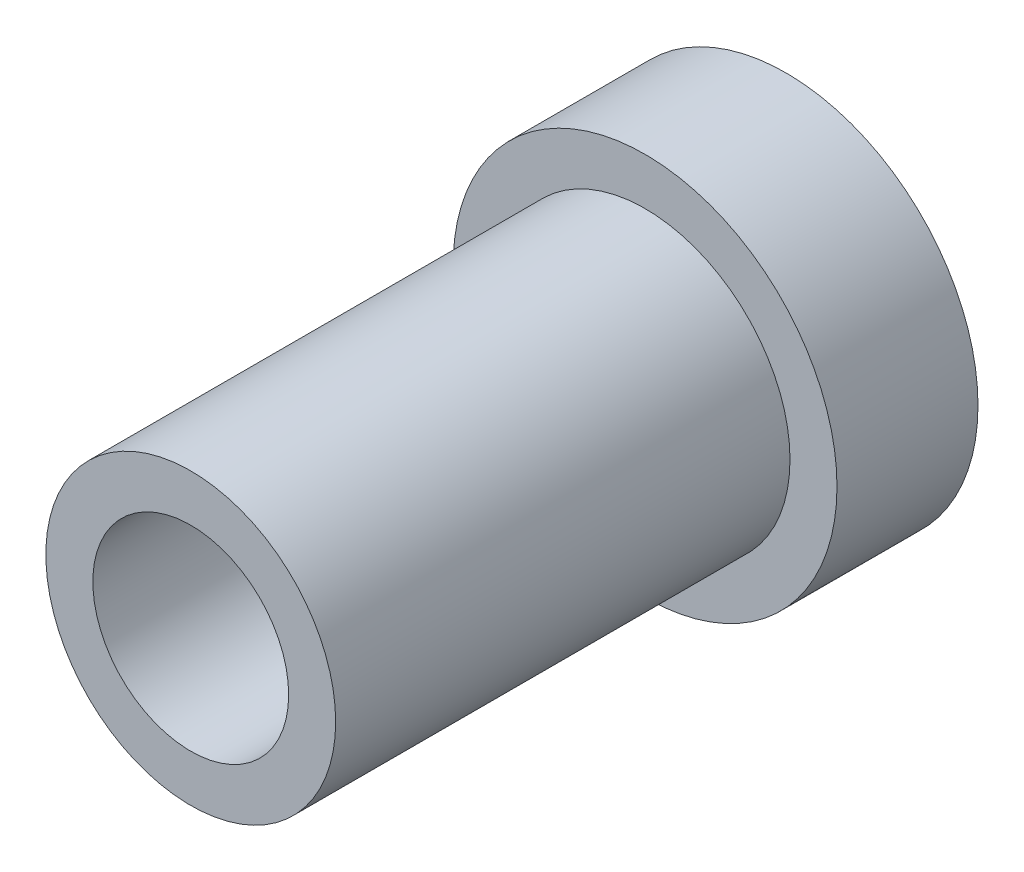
ISO-10303-21;
HEADER;
FILE_DESCRIPTION(('STEP AP214'),'2;1');
FILE_NAME('part.step','',(''),(''),'','','');
FILE_SCHEMA(('AUTOMOTIVE_DESIGN { 1 0 10303 214 1 1 1 1 }'));
ENDSEC;
DATA;
#1=APPLICATION_CONTEXT('core data for automotive mechanical design processes');
#2=APPLICATION_PROTOCOL_DEFINITION('international standard','automotive_design',2000,#1);
#3=PRODUCT_CONTEXT('',#1,'mechanical');
#4=PRODUCT('Part','Part','',(#3));
#5=PRODUCT_RELATED_PRODUCT_CATEGORY('part','',(#4));
#6=PRODUCT_DEFINITION_FORMATION('','',#4);
#7=PRODUCT_DEFINITION_CONTEXT('part definition',#1,'design');
#8=PRODUCT_DEFINITION('design','',#6,#7);
#9=PRODUCT_DEFINITION_SHAPE('','',#8);
#10=(LENGTH_UNIT() NAMED_UNIT(*) SI_UNIT(.MILLI.,.METRE.));
#11=(NAMED_UNIT(*) PLANE_ANGLE_UNIT() SI_UNIT($,.RADIAN.));
#12=(NAMED_UNIT(*) SI_UNIT($,.STERADIAN.) SOLID_ANGLE_UNIT());
#13=UNCERTAINTY_MEASURE_WITH_UNIT(LENGTH_MEASURE(1.E-05),#10,'distance_accuracy_value','');
#14=(GEOMETRIC_REPRESENTATION_CONTEXT(3) GLOBAL_UNCERTAINTY_ASSIGNED_CONTEXT((#13)) GLOBAL_UNIT_ASSIGNED_CONTEXT((#10,
#11,#12)) REPRESENTATION_CONTEXT('',''));
#15=CARTESIAN_POINT('',(0.,0.,0.));
#16=DIRECTION('',(0.,0.,1.));
#17=DIRECTION('',(1.,0.,0.));
#18=AXIS2_PLACEMENT_3D('',#15,#16,#17);
#19=CARTESIAN_POINT('',(0.,0.,19.304));
#20=DIRECTION('',(0.,0.,-1.));
#21=DIRECTION('',(-1.,0.,0.));
#22=AXIS2_PLACEMENT_3D('',#19,#20,#21);
#23=CYLINDRICAL_SURFACE('',#22,2.286);
#24=CARTESIAN_POINT('',(0.,0.,0.));
#25=DIRECTION('',(0.,0.,-1.));
#26=DIRECTION('',(-1.,0.,0.));
#27=AXIS2_PLACEMENT_3D('',#24,#25,#26);
#28=CIRCLE('',#27,2.286);
#29=CARTESIAN_POINT('',(-2.286,0.,0.));
#30=VERTEX_POINT('',#29);
#31=EDGE_CURVE('E48',#30,#30,#28,.T.);
#32=ORIENTED_EDGE('',*,*,#31,.T.);
#33=EDGE_LOOP('',(#32));
#34=FACE_BOUND('',#33,.T.);
#35=CARTESIAN_POINT('',(-2.35922392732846E-13,0.,12.192));
#36=DIRECTION('',(0.,0.,1.));
#37=DIRECTION('',(1.,0.,0.));
#38=AXIS2_PLACEMENT_3D('',#35,#36,#37);
#39=CIRCLE('',#38,2.286);
#40=CARTESIAN_POINT('',(2.28599999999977,0.,12.192));
#41=VERTEX_POINT('',#40);
#42=EDGE_CURVE('E32',#41,#41,#39,.F.);
#43=ORIENTED_EDGE('',*,*,#42,.F.);
#44=EDGE_LOOP('',(#43));
#45=FACE_BOUND('',#44,.T.);
#46=ADVANCED_FACE('F28',(#34,#45),#23,.F.);
#47=CARTESIAN_POINT('',(0.,0.,4.57199999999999));
#48=DIRECTION('',(0.,0.,1.));
#49=DIRECTION('',(1.,0.,0.));
#50=AXIS2_PLACEMENT_3D('',#47,#48,#49);
#51=PLANE('',#50);
#52=CARTESIAN_POINT('',(0.,0.,4.57199999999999));
#53=DIRECTION('',(0.,0.,1.));
#54=DIRECTION('',(1.,0.,0.));
#55=AXIS2_PLACEMENT_3D('',#52,#53,#54);
#56=CIRCLE('',#55,6.223);
#57=CARTESIAN_POINT('',(6.22300000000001,0.,4.57199999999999));
#58=VERTEX_POINT('',#57);
#59=EDGE_CURVE('E10',#58,#58,#56,.T.);
#60=ORIENTED_EDGE('',*,*,#59,.T.);
#61=EDGE_LOOP('',(#60));
#62=FACE_BOUND('',#61,.T.);
#63=CARTESIAN_POINT('',(0.,0.,4.57199999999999));
#64=DIRECTION('',(0.,0.,1.));
#65=DIRECTION('',(1.,0.,0.));
#66=AXIS2_PLACEMENT_3D('',#63,#64,#65);
#67=CIRCLE('',#66,4.699);
#68=CARTESIAN_POINT('',(4.69900000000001,0.,4.57199999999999));
#69=VERTEX_POINT('',#68);
#70=EDGE_CURVE('E45',#69,#69,#67,.T.);
#71=ORIENTED_EDGE('',*,*,#70,.F.);
#72=EDGE_LOOP('',(#71));
#73=FACE_BOUND('',#72,.T.);
#74=ADVANCED_FACE('F74',(#62,#73),#51,.T.);
#75=CARTESIAN_POINT('',(0.,0.,4.57199999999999));
#76=DIRECTION('',(0.,0.,-1.));
#77=DIRECTION('',(-1.,0.,0.));
#78=AXIS2_PLACEMENT_3D('',#75,#76,#77);
#79=CYLINDRICAL_SURFACE('',#78,6.223);
#80=ORIENTED_EDGE('',*,*,#59,.F.);
#81=EDGE_LOOP('',(#80));
#82=FACE_BOUND('',#81,.T.);
#83=CARTESIAN_POINT('',(0.,0.,0.));
#84=DIRECTION('',(0.,0.,1.));
#85=DIRECTION('',(1.,0.,0.));
#86=AXIS2_PLACEMENT_3D('',#83,#84,#85);
#87=CIRCLE('',#86,6.223);
#88=CARTESIAN_POINT('',(6.22300000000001,0.,0.));
#89=VERTEX_POINT('',#88);
#90=EDGE_CURVE('E36',#89,#89,#87,.T.);
#91=ORIENTED_EDGE('',*,*,#90,.T.);
#92=EDGE_LOOP('',(#91));
#93=FACE_BOUND('',#92,.T.);
#94=ADVANCED_FACE('F30',(#82,#93),#79,.T.);
#95=CARTESIAN_POINT('',(0.,0.,0.));
#96=DIRECTION('',(0.,0.,1.));
#97=DIRECTION('',(1.,0.,0.));
#98=AXIS2_PLACEMENT_3D('',#95,#96,#97);
#99=PLANE('',#98);
#100=ORIENTED_EDGE('',*,*,#31,.F.);
#101=EDGE_LOOP('',(#100));
#102=FACE_BOUND('',#101,.T.);
#103=ORIENTED_EDGE('',*,*,#90,.F.);
#104=EDGE_LOOP('',(#103));
#105=FACE_BOUND('',#104,.T.);
#106=ADVANCED_FACE('F70',(#102,#105),#99,.F.);
#107=CARTESIAN_POINT('',(0.,0.,19.304));
#108=DIRECTION('',(0.,0.,-1.));
#109=DIRECTION('',(-1.,0.,0.));
#110=AXIS2_PLACEMENT_3D('',#107,#108,#109);
#111=CYLINDRICAL_SURFACE('',#110,4.699);
#112=CARTESIAN_POINT('',(0.,0.,19.304));
#113=DIRECTION('',(0.,0.,1.));
#114=DIRECTION('',(1.,0.,0.));
#115=AXIS2_PLACEMENT_3D('',#112,#113,#114);
#116=CIRCLE('',#115,4.699);
#117=CARTESIAN_POINT('',(4.69899999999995,0.,19.304));
#118=VERTEX_POINT('',#117);
#119=EDGE_CURVE('E40',#118,#118,#116,.T.);
#120=ORIENTED_EDGE('',*,*,#119,.F.);
#121=EDGE_LOOP('',(#120));
#122=FACE_BOUND('',#121,.T.);
#123=ORIENTED_EDGE('',*,*,#70,.T.);
#124=EDGE_LOOP('',(#123));
#125=FACE_BOUND('',#124,.T.);
#126=ADVANCED_FACE('F64',(#122,#125),#111,.T.);
#127=CARTESIAN_POINT('',(0.,0.,19.304));
#128=DIRECTION('',(0.,0.,1.));
#129=DIRECTION('',(1.,0.,0.));
#130=AXIS2_PLACEMENT_3D('',#127,#128,#129);
#131=PLANE('',#130);
#132=CARTESIAN_POINT('',(0.,0.,19.304));
#133=DIRECTION('',(0.,0.,1.));
#134=DIRECTION('',(1.,0.,0.));
#135=AXIS2_PLACEMENT_3D('',#132,#133,#134);
#136=CIRCLE('',#135,3.175);
#137=CARTESIAN_POINT('',(3.17499999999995,0.,19.304));
#138=VERTEX_POINT('',#137);
#139=EDGE_CURVE('E54',#138,#138,#136,.T.);
#140=ORIENTED_EDGE('',*,*,#139,.F.);
#141=EDGE_LOOP('',(#140));
#142=FACE_BOUND('',#141,.T.);
#143=ORIENTED_EDGE('',*,*,#119,.T.);
#144=EDGE_LOOP('',(#143));
#145=FACE_BOUND('',#144,.T.);
#146=ADVANCED_FACE('F60',(#142,#145),#131,.T.);
#147=CARTESIAN_POINT('',(-2.35922392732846E-13,0.,12.192));
#148=DIRECTION('',(0.,0.,1.));
#149=DIRECTION('',(1.,0.,0.));
#150=AXIS2_PLACEMENT_3D('',#147,#148,#149);
#151=PLANE('',#150);
#152=CARTESIAN_POINT('',(-2.35922392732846E-13,0.,12.192));
#153=DIRECTION('',(0.,0.,1.));
#154=DIRECTION('',(1.,0.,0.));
#155=AXIS2_PLACEMENT_3D('',#152,#153,#154);
#156=CIRCLE('',#155,3.175);
#157=CARTESIAN_POINT('',(3.17499999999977,0.,12.192));
#158=VERTEX_POINT('',#157);
#159=EDGE_CURVE('E51',#158,#158,#156,.T.);
#160=ORIENTED_EDGE('',*,*,#159,.T.);
#161=EDGE_LOOP('',(#160));
#162=FACE_BOUND('',#161,.T.);
#163=ORIENTED_EDGE('',*,*,#42,.T.);
#164=EDGE_LOOP('',(#163));
#165=FACE_BOUND('',#164,.T.);
#166=ADVANCED_FACE('F63',(#162,#165),#151,.T.);
#167=CARTESIAN_POINT('',(-2.35922392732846E-13,0.,12.192));
#168=DIRECTION('',(0.,0.,1.));
#169=DIRECTION('',(1.,0.,0.));
#170=AXIS2_PLACEMENT_3D('',#167,#168,#169);
#171=CYLINDRICAL_SURFACE('',#170,3.175);
#172=ORIENTED_EDGE('',*,*,#159,.F.);
#173=EDGE_LOOP('',(#172));
#174=FACE_BOUND('',#173,.T.);
#175=ORIENTED_EDGE('',*,*,#139,.T.);
#176=EDGE_LOOP('',(#175));
#177=FACE_BOUND('',#176,.T.);
#178=ADVANCED_FACE('F58',(#174,#177),#171,.F.);
#179=CLOSED_SHELL('',(#46,#74,#94,#106,#126,#146,#166,#178));
#180=MANIFOLD_SOLID_BREP('B2',#179);
#181=ADVANCED_BREP_SHAPE_REPRESENTATION('',(#18,#180),#14);
#182=SHAPE_DEFINITION_REPRESENTATION(#9,#181);
ENDSEC;
END-ISO-10303-21;
